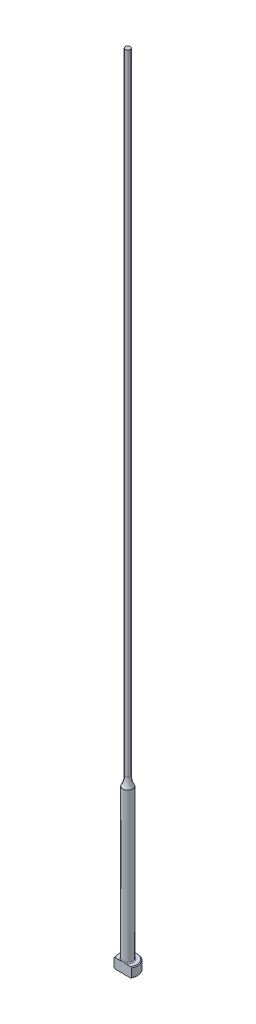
from build123d import *

# Parameters (mm, degrees)
CHAMFER1_SIZE = 0.254
FILLET1_R     = 0.254
KEY_DEPTH     = 255.0396844


with BuildPart() as part:
    # Sketch1 → Revolve1 (revolve)
    with BuildSketch(Plane.XY, mode=Mode.PRIVATE) as revolve1_sk:
        with BuildLine():
            Line((0, 0), (-3.175, 0))
            Line((-3.175, 0), (-3.175, 3.175))
            Line((-3.175, 3.175), (-1.5875, 3.175))
            Line((-1.5875, 3.175), (-1.5875, 50.8))
            ThreePointArc((-1.5875, 50.8), (-0.995388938, 52.286680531), (-0.79375, 53.874180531))
            Line((-0.79375, 53.874180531), (-0.79375, 254))
            Line((-0.79375, 254), (0, 254))
            Line((0, 254), (0, 0))
        make_face()
    revolve(revolve1_sk.sketch.rotate(Axis((0, 259.958771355, 0), (0, -1, 0)), 270), axis=Axis((0, 259.958771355, 0), (0, -1, 0)))

    # Chamfer1
    chamfer1_edges = [part.edges().sort_by_distance(p)[0] for p in [
        (0, 0, -3.175),
        (0, 3.175, -3.175),
    ]]
    chamfer(chamfer1_edges, length=CHAMFER1_SIZE)

    # Fillet1
    fillet1_edges = [part.edges().sort_by_distance(p)[0] for p in [
        (0, 3.175, -1.5875),
    ]]
    fillet(fillet1_edges, radius=FILLET1_R)

    # Sketch2 → KEY (cut, through all)
    with BuildSketch(Plane.XZ):
        with BuildLine():
            Line((-2.749630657, 1.5875), (2.749630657, 1.5875))
            ThreePointArc((2.749630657, 1.5875), (0, 3.175), (-2.749630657, 1.5875))
        make_face()
    extrude(amount=-KEY_DEPTH, mode=Mode.SUBTRACT)


solid = part.part
